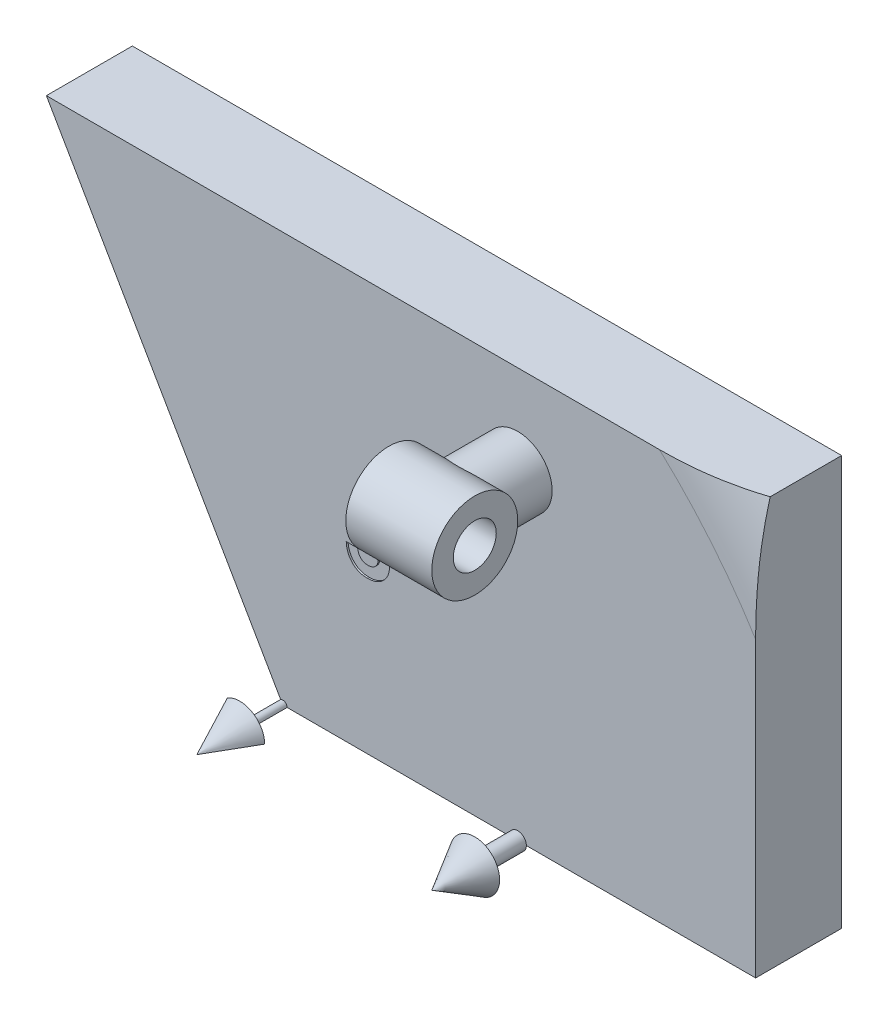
from build123d import *

# Parameters (mm, degrees)
BOSS_EXTRU_1_DEPTH      = 10
ESQUISSE3_R             = 5
ESQUISSE3_R_2           = 2.5
BOSS_EXTRU_2_DEPTH      = 5
BOSS_EXTRU_3_REACH      = 76.288
BOSS_EXTRU_3_END_RADIUS = 5
ESQUISSE4_R             = 4
R_VOLUTION1_ANGLE       = 120
ENL_V_MAT_EXTRU_2_DEPTH = 0.2


with BuildPart() as part:
    # Esquisse1 → Boss.-Extru.1 (new body)
    with BuildSketch(Plane.XY):
        Polygon((-27.5, 47.631397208), (55, 47.631397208), (55, 0), (0, 0), align=None)
    extrude(amount=BOSS_EXTRU_1_DEPTH)



with BuildPart() as body_2:
    # Esquisse3 → Boss.-Extru.2 (new, symmetric)
    with BuildSketch(Plane(origin=(27.33, 0, 0), x_dir=(0, 0, -1), z_dir=(1, 0, 0))):
        with Locations(Location((-20, 37.23, 0), (0, 0, 90))):
            Circle(ESQUISSE3_R)
        with Locations(Location((-20, 37.23, 0), (0, 0, 90))):
            Circle(ESQUISSE3_R_2, mode=Mode.SUBTRACT)
    extrude(amount=BOSS_EXTRU_2_DEPTH, both=True)


with BuildPart() as part_1:
    add(part.part)

    add(body_2.part)  # Boss.-Extru.3 merges body 2
    # Boss.-Extru.3: up to this cylinder (the profile starts outside it)
    boss_extru_3_end = Plane(origin=(27.33, 37.23, 20), z_dir=(-1, 0, 0)) * Cylinder(BOSS_EXTRU_3_END_RADIUS, 163.576, mode=Mode.PRIVATE)
    # Esquisse4 → Boss.-Extru.3 (add, up to the surface)
    with BuildSketch(Plane.XY.offset(10), mode=Mode.PRIVATE) as boss_extru_3_sk1:
        with Locations(Location((27.33, 37.23, 0), (0, 0, 180))):
            Circle(ESQUISSE4_R)
    boss_extru_3_tool1 = extrude(boss_extru_3_sk1.sketch, amount=BOSS_EXTRU_3_REACH, mode=Mode.PRIVATE) - boss_extru_3_end
    add(boss_extru_3_tool1.solids().sort_by_distance((27.33, 37.23, 10))[0])

    # Esquisse9 → R_volution1 (revolve)
    with BuildSketch(Plane.XZ):
        Polygon((0.5, 10), (0.5, 15), (2.886751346, 15), (0, 20), (0, 10), align=None)
    revolve(axis=Axis((0, 0, 10), (0, 0, 1)), revolution_arc=R_VOLUTION1_ANGLE)

    # Esquisse10 → R_volution2 (revolve)
    with BuildSketch(Plane(origin=(27.33, 0, 0), x_dir=(0, 0, -1), z_dir=(1, 0, 0))):
        Polygon((-10, 0), (-10, 1), (-15, 1), (-15, 2.886751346), (-20, 0), align=None)
    revolve(axis=Axis((27.33, 0, 10), (0, 0, 1)))

    # Esquisse8 → Enl_v. mat.-Extru.2 (cut)
    with BuildSketch(Plane.XY.offset(10)):
        with BuildLine():
            Line((9.084102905, 23.482172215), (7.754402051, 23.482172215))
            add(Edge.make_bspline(
                [(7.754402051, 23.482172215), (7.763790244, 23.548639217), (7.782195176, 23.678943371), (7.826235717, 23.867591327), (7.878912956, 24.046536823), (7.944677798, 24.215213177), (8.021809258, 24.373920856), (8.109522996, 24.523204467), (8.20876723, 24.662423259), (8.284838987, 24.746289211), (8.322789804, 24.788128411)],
                knots=[0, 0, 0, 0, 1.111473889, 2.178970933, 3.205615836, 4.199322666, 5.174200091, 6.12565194, 7.064921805, 8, 8, 8, 8], degree=3))
            add(Edge.make_bspline(
                [(8.322789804, 24.788128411), (8.37752883, 24.843332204), (8.485413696, 24.952133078), (8.665701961, 25.091494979), (8.854677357, 25.212103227), (9.05612987, 25.307722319), (9.266924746, 25.385114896), (9.488738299, 25.437099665), (9.720664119, 25.471592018), (9.878924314, 25.474989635), (9.959687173, 25.476723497)],
                knots=[0, 0, 0, 0, 1.01925491, 2.00884431, 2.983262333, 3.955970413, 4.92937149, 5.924503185, 6.940838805, 8, 8, 8, 8], degree=3))
            add(Edge.make_bspline(
                [(9.959687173, 25.476723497), (10.031489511, 25.475028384), (10.172638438, 25.471696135), (10.380091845, 25.444946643), (10.577881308, 25.398031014), (10.768097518, 25.336689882), (10.947943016, 25.253225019), (11.121387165, 25.156340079), (11.283583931, 25.037506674), (11.434912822, 24.903236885), (11.57393727, 24.758010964), (11.694333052, 24.602776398), (11.797839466, 24.441679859), (11.88311506, 24.273382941), (11.948680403, 24.097600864), (11.994184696, 23.915349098), (12.023968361, 23.727029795), (12.026935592, 23.599031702), (12.028440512, 23.534113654)],
                knots=[0, 0, 0, 0, 1.091422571, 2.145516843, 3.172569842, 4.178562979, 5.178154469, 6.181868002, 7.194278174, 8.227918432, 9.254613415, 10.245994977, 11.209837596, 12.161663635, 13.10878368, 14.055455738, 15.013766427, 16, 16, 16, 16], degree=3))
            add(Edge.make_bspline(
                [(12.028440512, 23.534113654), (12.025352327, 23.453718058), (12.01927264, 23.295443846), (11.969384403, 23.063797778), (11.891295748, 22.842302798), (11.77848909, 22.634057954), (11.637452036, 22.439629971), (11.464404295, 22.265519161), (11.264274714, 22.108995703), (11.114034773, 22.024879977), (11.037101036, 21.98180663)],
                knots=[0, 0, 0, 0, 0.992805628, 1.954529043, 2.915727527, 3.886831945, 4.871318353, 5.87440735, 6.911542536, 8, 8, 8, 8], degree=3))
            add(Edge.make_bspline(
                [(11.037101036, 21.98180663), (11.089907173, 21.964469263), (11.193668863, 21.930402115), (11.34115363, 21.863307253), (11.481394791, 21.78998369), (11.611977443, 21.704801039), (11.734200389, 21.611203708), (11.847318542, 21.508391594), (11.952007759, 21.396588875), (12.046559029, 21.275180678), (12.130476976, 21.146108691), (12.205772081, 21.0123544), (12.267744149, 20.871889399), (12.320242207, 20.726317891), (12.360211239, 20.574331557), (12.388353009, 20.416519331), (12.404619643, 20.253241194), (12.407100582, 20.142620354), (12.408355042, 20.086686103)],
                knots=[0, 0, 0, 0, 1.059543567, 2.081955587, 3.086750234, 4.076226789, 5.052108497, 6.020845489, 6.989030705, 7.970690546, 8.952259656, 9.923888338, 10.895517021, 11.877585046, 12.873342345, 13.889638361, 14.932918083, 16, 16, 16, 16], degree=3))
            add(Edge.make_bspline(
                [(12.408355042, 20.086686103), (12.405812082, 20.004485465), (12.400797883, 19.842402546), (12.368919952, 19.603670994), (12.309568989, 19.37606167), (12.231489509, 19.156955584), (12.127339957, 18.949181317), (12.004773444, 18.747970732), (11.854114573, 18.560301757), (11.686683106, 18.381212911), (11.500740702, 18.218393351), (11.299148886, 18.07723612), (11.086340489, 17.9560981), (10.860969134, 17.857754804), (10.623113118, 17.782019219), (10.373302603, 17.727274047), (10.110487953, 17.693780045), (9.931096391, 17.690268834), (9.839479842, 17.688475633)],
                knots=[0, 0, 0, 0, 1.005138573, 1.981928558, 2.936866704, 3.876260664, 4.820238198, 5.773547, 6.751179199, 7.756627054, 8.768222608, 9.766606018, 10.760583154, 11.757261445, 12.767156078, 13.807575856, 14.880313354, 16, 16, 16, 16], degree=3))
            add(Edge.make_bspline(
                [(9.839479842, 17.688475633), (9.752812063, 17.69036626), (9.583344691, 17.694063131), (9.335463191, 17.726061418), (9.09987529, 17.777677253), (8.875979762, 17.850434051), (8.664642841, 17.944787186), (8.463948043, 18.057140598), (8.277900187, 18.193974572), (8.104426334, 18.349112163), (7.947374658, 18.523167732), (7.807007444, 18.712109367), (7.686419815, 18.916655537), (7.585117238, 19.135932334), (7.503891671, 19.370324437), (7.439821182, 19.619355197), (7.395066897, 19.883511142), (7.381436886, 20.065256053), (7.374487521, 20.157920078)],
                knots=[0, 0, 0, 0, 1.066544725, 2.085487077, 3.070979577, 4.031932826, 4.977951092, 5.916076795, 6.857635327, 7.814973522, 8.776389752, 9.738577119, 10.707772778, 11.69409279, 12.707140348, 13.757286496, 14.856535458, 16, 16, 16, 16], degree=3))
            Line((7.374487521, 20.157920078), (8.704188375, 20.157920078))
            add(Edge.make_bspline(
                [(8.704188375, 20.157920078), (8.712614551, 20.11132739), (8.729026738, 20.02057591), (8.761037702, 19.889187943), (8.802752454, 19.767908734), (8.850985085, 19.655660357), (8.903083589, 19.55096903), (8.96603104, 19.457701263), (9.03521498, 19.373324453), (9.13504791, 19.273016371), (9.277765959, 19.169954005), (9.470482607, 19.080387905), (9.684861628, 19.027891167), (9.834733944, 19.021486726), (9.912197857, 19.018176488)],
                knots=[0, 0, 0, 0, 0.928156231, 1.807827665, 2.648129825, 3.438902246, 4.202261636, 4.936546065, 5.639352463, 6.338805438, 7.70633318, 9.064371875, 10.482673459, 12, 12, 12, 12], degree=3))
            add(Edge.make_bspline(
                [(9.912197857, 19.018176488), (9.953302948, 19.018881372), (10.033818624, 19.020262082), (10.152084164, 19.035565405), (10.264748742, 19.060769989), (10.372022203, 19.095022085), (10.474587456, 19.137959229), (10.570484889, 19.193324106), (10.661669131, 19.257693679), (10.747148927, 19.330062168), (10.82613402, 19.408917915), (10.891854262, 19.496237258), (10.951917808, 19.584969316), (10.99634124, 19.680919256), (11.035265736, 19.778923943), (11.059089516, 19.882540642), (11.077078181, 19.989595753), (11.07812361, 20.062859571), (11.078654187, 20.100042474)],
                knots=[0, 0, 0, 0, 1.110435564, 2.175094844, 3.216326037, 4.226890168, 5.215276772, 6.21526065, 7.213097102, 8.228249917, 9.239874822, 10.221364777, 11.178138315, 12.128914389, 13.072518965, 14.022636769, 14.996447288, 16, 16, 16, 16], degree=3))
            add(Edge.make_bspline(
                [(11.078654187, 20.100042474), (11.077245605, 20.140708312), (11.074441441, 20.221664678), (11.051531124, 20.339803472), (11.015350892, 20.453443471), (10.965092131, 20.562081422), (10.897977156, 20.665316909), (10.818782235, 20.765221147), (10.721268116, 20.856594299), (10.614282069, 20.946913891), (10.490220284, 21.025645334), (10.355124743, 21.098302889), (10.205444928, 21.156115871), (10.044834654, 21.207753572), (9.87025583, 21.245468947), (9.682792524, 21.272853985), (9.482747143, 21.293237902), (9.344853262, 21.296162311), (9.27406017, 21.297663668)],
                knots=[0, 0, 0, 0, 0.809814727, 1.612155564, 2.388397, 3.182215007, 3.988903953, 4.837162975, 5.715530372, 6.646997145, 7.623086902, 8.637258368, 9.698941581, 10.815059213, 11.996518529, 13.252603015, 14.589518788, 16, 16, 16, 16], degree=3))
            Line((9.27406017, 21.297663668), (9.27406017, 22.53238589))
            add(Edge.make_bspline(
                [(9.27406017, 22.53238589), (9.36220178, 22.539892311), (9.527097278, 22.553935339), (9.755981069, 22.586775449), (9.948671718, 22.630671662), (10.109800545, 22.683630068), (10.2435916, 22.751642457), (10.360470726, 22.826725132), (10.461132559, 22.913922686), (10.54620531, 23.0106349), (10.614260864, 23.114494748), (10.662426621, 23.223887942), (10.69423277, 23.33542972), (10.697246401, 23.411720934), (10.698739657, 23.44952331)],
                knots=[0, 0, 0, 0, 1.70044513, 3.18119609, 4.440695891, 5.496282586, 6.431922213, 7.318171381, 8.16090191, 8.983045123, 9.787564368, 10.536848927, 11.275007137, 12, 12, 12, 12], degree=3))
            add(Edge.make_bspline(
                [(10.698739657, 23.44952331), (10.696163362, 23.497755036), (10.691134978, 23.591893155), (10.652081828, 23.726624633), (10.584289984, 23.84672658), (10.493393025, 23.951946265), (10.38263192, 24.039833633), (10.252800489, 24.103638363), (10.10671608, 24.141126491), (10.003937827, 24.145012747), (9.950782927, 24.147022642)],
                knots=[0, 0, 0, 0, 1.009664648, 1.970651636, 2.907870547, 3.878035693, 4.867062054, 5.849714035, 6.887914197, 8, 8, 8, 8], degree=3))
            add(Edge.make_bspline(
                [(9.950782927, 24.147022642), (9.902603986, 24.144651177), (9.807002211, 24.139945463), (9.667203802, 24.104823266), (9.534441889, 24.045699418), (9.411465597, 23.964171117), (9.300050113, 23.866259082), (9.208610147, 23.7503026), (9.132554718, 23.623248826), (9.100316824, 23.529382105), (9.084102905, 23.482172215)],
                knots=[0, 0, 0, 0, 0.98818071, 1.960853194, 2.938124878, 3.957524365, 4.978590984, 5.968022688, 6.978025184, 8, 8, 8, 8], degree=3))
        make_face()
    extrude(amount=-ENL_V_MAT_EXTRU_2_DEPTH, mode=Mode.SUBTRACT)

    # Esquisse11 → Enl_vement de mati_re-R_volution1 (revolve, cut)
    with BuildSketch(Plane(origin=(0, 0, 0), x_dir=(0.866025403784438, 0.500000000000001, 0), z_dir=(0.500000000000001, -0.866025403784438, 0))):
        with BuildLine():
            Line((64.715728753, 10), (64.715728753, 16.68165023))
            Line((64.715728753, 16.68165023), (78.857864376, 16.68165023))
            Line((78.857864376, 16.68165023), (78.857864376, 4.142135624))
            ThreePointArc((78.857864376, 4.142135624), (72.3693974, 8.47759065), (64.715728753, 10))
        make_face()
    revolve(axis=Axis((0, 0, 0), (0, 0, 1)), mode=Mode.SUBTRACT)


solid = part_1.part
